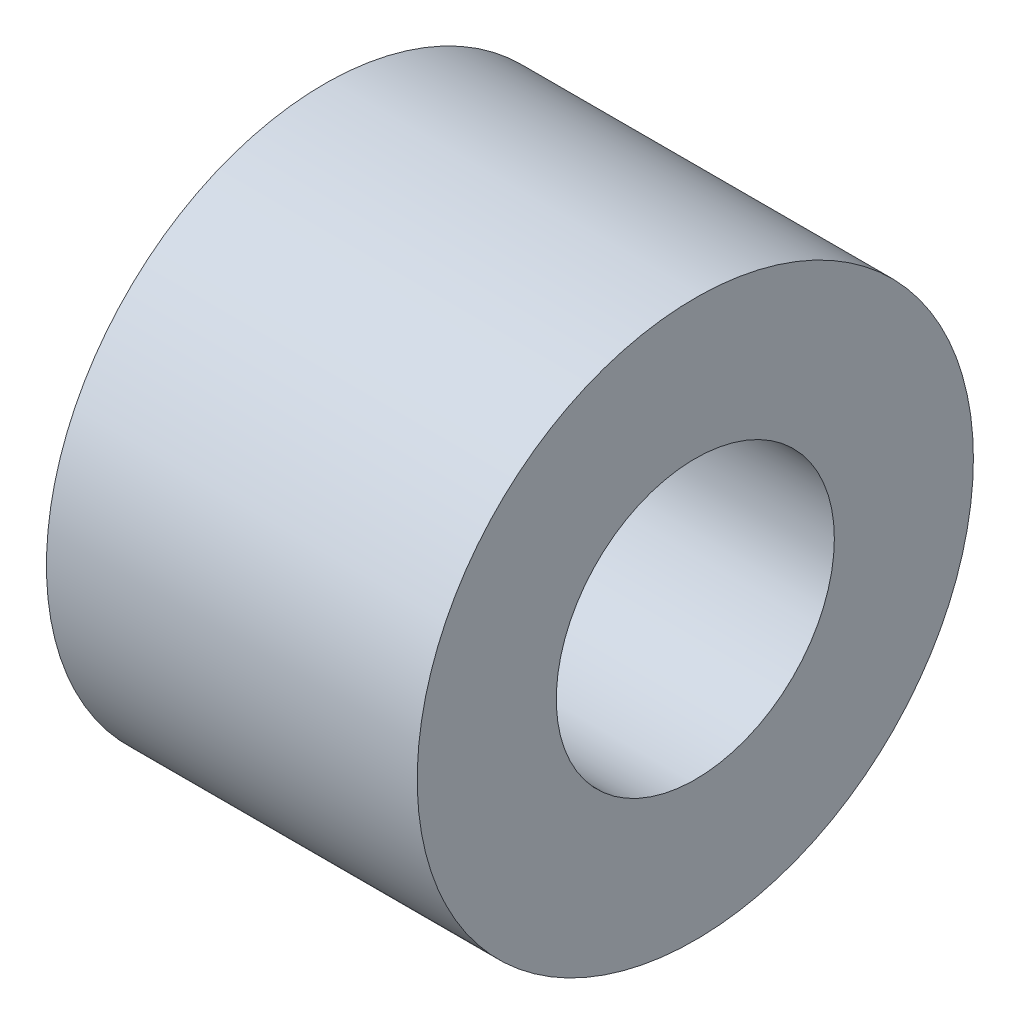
from build123d import *

# Parameters (mm, degrees)
SKETCH1_R      = 2.38125
EXTRUDE1_DEPTH = 3.175
SKETCH2_R      = 1.190625
EXTRUDE2_DEPTH = 5.628318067


with BuildPart() as part:
    # Sketch1 → Extrude1 (new body)
    with BuildSketch(Plane(origin=(0, 0, 0), x_dir=(0, 0, -1), z_dir=(1, 0, 0))):
        Circle(SKETCH1_R)
    extrude(amount=EXTRUDE1_DEPTH)

    # Sketch2 → Extrude2 (cut, through all)
    with BuildSketch(Plane(origin=(3.175, 0, 0), x_dir=(0, 0, -1), z_dir=(1, 0, 0))):
        Circle(SKETCH2_R)
    extrude(amount=-EXTRUDE2_DEPTH, mode=Mode.SUBTRACT)


solid = part.part
